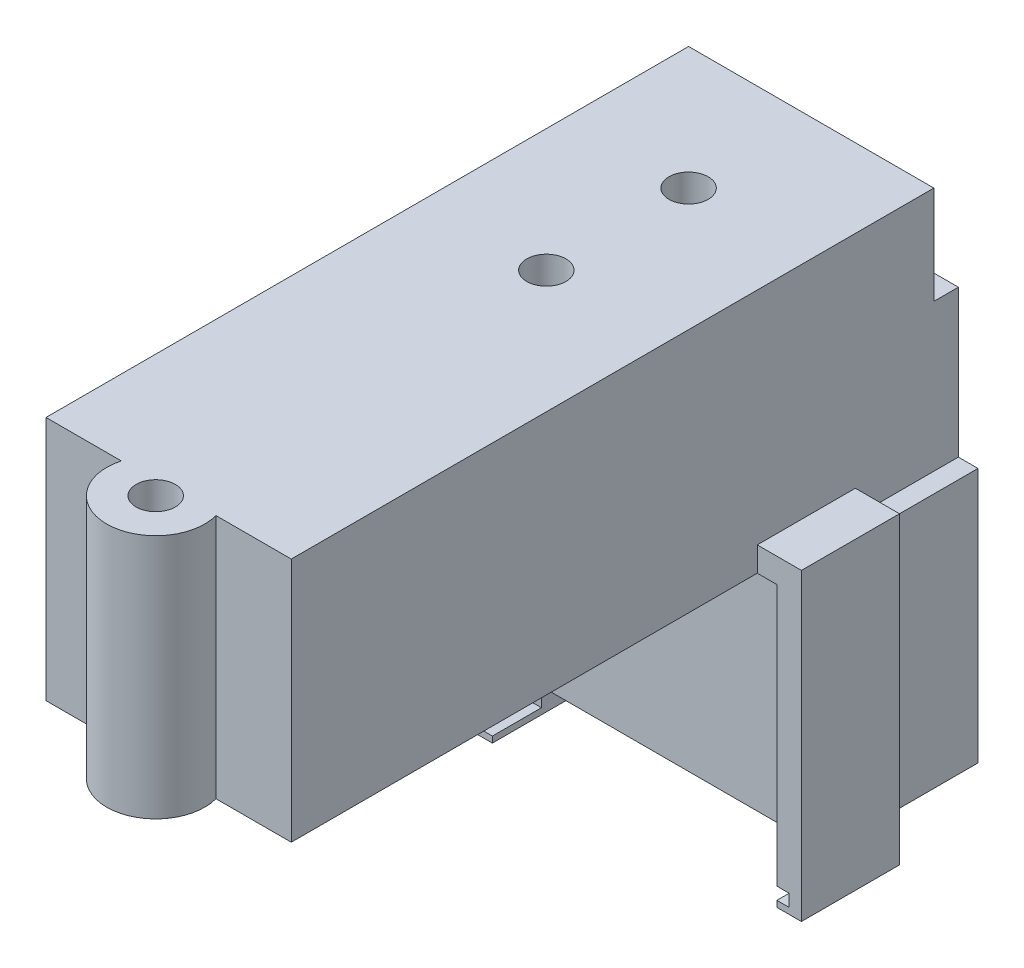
ISO-10303-21;
HEADER;
FILE_DESCRIPTION(('STEP AP214'),'2;1');
FILE_NAME('part.step','',(''),(''),'','','');
FILE_SCHEMA(('AUTOMOTIVE_DESIGN { 1 0 10303 214 1 1 1 1 }'));
ENDSEC;
DATA;
#1=APPLICATION_CONTEXT('core data for automotive mechanical design processes');
#2=APPLICATION_PROTOCOL_DEFINITION('international standard','automotive_design',2000,#1);
#3=PRODUCT_CONTEXT('',#1,'mechanical');
#4=PRODUCT('Part','Part','',(#3));
#5=PRODUCT_RELATED_PRODUCT_CATEGORY('part','',(#4));
#6=PRODUCT_DEFINITION_FORMATION('','',#4);
#7=PRODUCT_DEFINITION_CONTEXT('part definition',#1,'design');
#8=PRODUCT_DEFINITION('design','',#6,#7);
#9=PRODUCT_DEFINITION_SHAPE('','',#8);
#10=(LENGTH_UNIT() NAMED_UNIT(*) SI_UNIT(.MILLI.,.METRE.));
#11=(NAMED_UNIT(*) PLANE_ANGLE_UNIT() SI_UNIT($,.RADIAN.));
#12=(NAMED_UNIT(*) SI_UNIT($,.STERADIAN.) SOLID_ANGLE_UNIT());
#13=UNCERTAINTY_MEASURE_WITH_UNIT(LENGTH_MEASURE(1.E-05),#10,'distance_accuracy_value','');
#14=(GEOMETRIC_REPRESENTATION_CONTEXT(3) GLOBAL_UNCERTAINTY_ASSIGNED_CONTEXT((#13)) GLOBAL_UNIT_ASSIGNED_CONTEXT((#10,
#11,#12)) REPRESENTATION_CONTEXT('',''));
#15=CARTESIAN_POINT('',(0.,0.,0.));
#16=DIRECTION('',(0.,0.,1.));
#17=DIRECTION('',(1.,0.,0.));
#18=AXIS2_PLACEMENT_3D('',#15,#16,#17);
#19=CARTESIAN_POINT('',(25.,50.,58.63));
#20=DIRECTION('',(0.,-1.,0.));
#21=DIRECTION('',(0.,0.,-1.));
#22=AXIS2_PLACEMENT_3D('',#19,#20,#21);
#23=CYLINDRICAL_SURFACE('',#22,4.);
#24=CARTESIAN_POINT('',(25.,50.,58.63));
#25=DIRECTION('',(0.,-1.,0.));
#26=DIRECTION('',(0.,0.,-1.));
#27=AXIS2_PLACEMENT_3D('',#24,#25,#26);
#28=CIRCLE('',#27,4.);
#29=CARTESIAN_POINT('',(25.,50.,54.63));
#30=VERTEX_POINT('',#29);
#31=EDGE_CURVE('E294',#30,#30,#28,.T.);
#32=ORIENTED_EDGE('',*,*,#31,.F.);
#33=EDGE_LOOP('',(#32));
#34=FACE_BOUND('',#33,.T.);
#35=CARTESIAN_POINT('',(25.,10.,58.63));
#36=DIRECTION('',(0.,-1.,0.));
#37=DIRECTION('',(0.,0.,-1.));
#38=AXIS2_PLACEMENT_3D('',#35,#36,#37);
#39=CIRCLE('',#38,4.);
#40=CARTESIAN_POINT('',(25.,10.,54.63));
#41=VERTEX_POINT('',#40);
#42=EDGE_CURVE('E12',#41,#41,#39,.F.);
#43=ORIENTED_EDGE('',*,*,#42,.F.);
#44=EDGE_LOOP('',(#43));
#45=FACE_BOUND('',#44,.T.);
#46=ADVANCED_FACE('F47',(#34,#45),#23,.F.);
#47=CARTESIAN_POINT('',(0.,50.,0.));
#48=DIRECTION('',(1.,0.,0.));
#49=DIRECTION('',(0.,0.,-1.));
#50=AXIS2_PLACEMENT_3D('',#47,#48,#49);
#51=PLANE('',#50);
#52=DIRECTION('',(0.,1.,0.));
#53=VECTOR('',#52,1.);
#54=CARTESIAN_POINT('',(0.,5.,-59.));
#55=LINE('',#54,#53);
#56=CARTESIAN_POINT('',(0.,0.,-59.));
#57=VERTEX_POINT('',#56);
#58=CARTESIAN_POINT('',(0.,5.,-59.));
#59=VERTEX_POINT('',#58);
#60=EDGE_CURVE('E495',#57,#59,#55,.T.);
#61=ORIENTED_EDGE('',*,*,#60,.T.);
#62=DIRECTION('',(0.,0.,1.));
#63=VECTOR('',#62,1.);
#64=CARTESIAN_POINT('',(0.,5.,-59.));
#65=LINE('',#64,#63);
#66=CARTESIAN_POINT('',(0.,5.,-39.));
#67=VERTEX_POINT('',#66);
#68=EDGE_CURVE('E534',#59,#67,#65,.T.);
#69=ORIENTED_EDGE('',*,*,#68,.T.);
#70=DIRECTION('',(0.,1.,0.));
#71=VECTOR('',#70,1.);
#72=CARTESIAN_POINT('',(0.,5.,-39.));
#73=LINE('',#72,#71);
#74=CARTESIAN_POINT('',(0.,0.,-39.));
#75=VERTEX_POINT('',#74);
#76=EDGE_CURVE('E456',#75,#67,#73,.T.);
#77=ORIENTED_EDGE('',*,*,#76,.F.);
#78=DIRECTION('',(0.,0.,1.));
#79=VECTOR('',#78,1.);
#80=CARTESIAN_POINT('',(0.,0.,0.));
#81=LINE('',#80,#79);
#82=CARTESIAN_POINT('',(0.,0.,56.));
#83=VERTEX_POINT('',#82);
#84=EDGE_CURVE('E643',#75,#83,#81,.T.);
#85=ORIENTED_EDGE('',*,*,#84,.T.);
#86=DIRECTION('',(0.,-1.,0.));
#87=VECTOR('',#86,1.);
#88=CARTESIAN_POINT('',(0.,50.,56.));
#89=LINE('',#88,#87);
#90=CARTESIAN_POINT('',(0.,50.,56.));
#91=VERTEX_POINT('',#90);
#92=EDGE_CURVE('E315',#91,#83,#89,.T.);
#93=ORIENTED_EDGE('',*,*,#92,.F.);
#94=DIRECTION('',(0.,0.,1.));
#95=VECTOR('',#94,1.);
#96=CARTESIAN_POINT('',(0.,50.,0.));
#97=LINE('',#96,#95);
#98=CARTESIAN_POINT('',(0.,50.,-75.));
#99=VERTEX_POINT('',#98);
#100=EDGE_CURVE('E635',#99,#91,#97,.T.);
#101=ORIENTED_EDGE('',*,*,#100,.F.);
#102=DIRECTION('',(0.,1.,0.));
#103=VECTOR('',#102,1.);
#104=CARTESIAN_POINT('',(0.,50.,-75.));
#105=LINE('',#104,#103);
#106=CARTESIAN_POINT('',(0.,30.,-75.));
#107=VERTEX_POINT('',#106);
#108=EDGE_CURVE('E598',#107,#99,#105,.T.);
#109=ORIENTED_EDGE('',*,*,#108,.F.);
#110=DIRECTION('',(0.,0.,1.));
#111=VECTOR('',#110,1.);
#112=CARTESIAN_POINT('',(0.,30.,-75.));
#113=LINE('',#112,#111);
#114=CARTESIAN_POINT('',(0.,30.,-80.));
#115=VERTEX_POINT('',#114);
#116=EDGE_CURVE('E604',#115,#107,#113,.T.);
#117=ORIENTED_EDGE('',*,*,#116,.F.);
#118=DIRECTION('',(0.,-1.,0.));
#119=VECTOR('',#118,1.);
#120=CARTESIAN_POINT('',(0.,50.,-80.));
#121=LINE('',#120,#119);
#122=CARTESIAN_POINT('',(0.,0.,-80.));
#123=VERTEX_POINT('',#122);
#124=EDGE_CURVE('E638',#115,#123,#121,.T.);
#125=ORIENTED_EDGE('',*,*,#124,.T.);
#126=EDGE_CURVE('E628',#123,#57,#81,.T.);
#127=ORIENTED_EDGE('',*,*,#126,.T.);
#128=EDGE_LOOP('',(#61,#69,#77,#85,#93,#101,#109,#117,#125,#127));
#129=FACE_BOUND('',#128,.T.);
#130=ADVANCED_FACE('F700',(#129),#51,.F.);
#131=CARTESIAN_POINT('',(54.,0.,-80.));
#132=DIRECTION('',(0.,-1.,0.));
#133=DIRECTION('',(0.,0.,-1.));
#134=AXIS2_PLACEMENT_3D('',#131,#132,#133);
#135=PLANE('',#134);
#136=DIRECTION('',(1.,0.,0.));
#137=VECTOR('',#136,1.);
#138=CARTESIAN_POINT('',(0.,0.,-59.));
#139=LINE('',#138,#137);
#140=CARTESIAN_POINT('',(-3.99999999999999,0.,-59.));
#141=VERTEX_POINT('',#140);
#142=EDGE_CURVE('E491',#141,#57,#139,.T.);
#143=ORIENTED_EDGE('',*,*,#142,.T.);
#144=ORIENTED_EDGE('',*,*,#126,.F.);
#145=DIRECTION('',(-1.,0.,0.));
#146=VECTOR('',#145,1.);
#147=CARTESIAN_POINT('',(54.,0.,-80.));
#148=LINE('',#147,#146);
#149=CARTESIAN_POINT('',(-4.,0.,-80.));
#150=VERTEX_POINT('',#149);
#151=EDGE_CURVE('E589',#123,#150,#148,.T.);
#152=ORIENTED_EDGE('',*,*,#151,.T.);
#153=DIRECTION('',(0.,0.,1.));
#154=VECTOR('',#153,1.);
#155=CARTESIAN_POINT('',(-4.,0.,-80.));
#156=LINE('',#155,#154);
#157=EDGE_CURVE('E552',#150,#141,#156,.T.);
#158=ORIENTED_EDGE('',*,*,#157,.T.);
#159=EDGE_LOOP('',(#143,#144,#152,#158));
#160=FACE_BOUND('',#159,.T.);
#161=ADVANCED_FACE('F666',(#160),#135,.F.);
#162=CARTESIAN_POINT('',(-3.99999999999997,0.,0.));
#163=DIRECTION('',(-1.,0.,0.));
#164=DIRECTION('',(0.,0.,1.));
#165=AXIS2_PLACEMENT_3D('',#162,#163,#164);
#166=PLANE('',#165);
#167=DIRECTION('',(0.,0.,-1.));
#168=VECTOR('',#167,1.);
#169=CARTESIAN_POINT('',(-4.,-52.,-80.));
#170=LINE('',#169,#168);
#171=CARTESIAN_POINT('',(-3.99999999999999,-52.,-59.));
#172=VERTEX_POINT('',#171);
#173=CARTESIAN_POINT('',(-4.,-52.,-80.));
#174=VERTEX_POINT('',#173);
#175=EDGE_CURVE('E560',#172,#174,#170,.T.);
#176=ORIENTED_EDGE('',*,*,#175,.F.);
#177=DIRECTION('',(0.,1.,0.));
#178=VECTOR('',#177,1.);
#179=CARTESIAN_POINT('',(-3.99999999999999,0.,-59.));
#180=LINE('',#179,#178);
#181=EDGE_CURVE('E56',#172,#141,#180,.T.);
#182=ORIENTED_EDGE('',*,*,#181,.T.);
#183=ORIENTED_EDGE('',*,*,#157,.F.);
#184=DIRECTION('',(0.,1.,0.));
#185=VECTOR('',#184,1.);
#186=CARTESIAN_POINT('',(-4.,0.,-80.));
#187=LINE('',#186,#185);
#188=EDGE_CURVE('E548',#174,#150,#187,.T.);
#189=ORIENTED_EDGE('',*,*,#188,.F.);
#190=EDGE_LOOP('',(#176,#182,#183,#189));
#191=FACE_BOUND('',#190,.T.);
#192=ADVANCED_FACE('F662',(#191),#166,.T.);
#193=CARTESIAN_POINT('',(25.,50.,-21.));
#194=DIRECTION('',(0.,-1.,0.));
#195=DIRECTION('',(0.,0.,-1.));
#196=AXIS2_PLACEMENT_3D('',#193,#194,#195);
#197=CYLINDRICAL_SURFACE('',#196,4.);
#198=CARTESIAN_POINT('',(25.,50.,-21.));
#199=DIRECTION('',(0.,1.,0.));
#200=DIRECTION('',(0.,0.,1.));
#201=AXIS2_PLACEMENT_3D('',#198,#199,#200);
#202=CIRCLE('',#201,4.);
#203=CARTESIAN_POINT('',(25.,50.,-17.));
#204=VERTEX_POINT('',#203);
#205=EDGE_CURVE('E623',#204,#204,#202,.T.);
#206=ORIENTED_EDGE('',*,*,#205,.T.);
#207=EDGE_LOOP('',(#206));
#208=FACE_BOUND('',#207,.T.);
#209=CARTESIAN_POINT('',(25.,25.,-21.));
#210=DIRECTION('',(0.,-1.,0.));
#211=DIRECTION('',(0.,0.,-1.));
#212=AXIS2_PLACEMENT_3D('',#209,#210,#211);
#213=CIRCLE('',#212,4.);
#214=CARTESIAN_POINT('',(25.,25.,-25.));
#215=VERTEX_POINT('',#214);
#216=EDGE_CURVE('E544',#215,#215,#213,.T.);
#217=ORIENTED_EDGE('',*,*,#216,.T.);
#218=EDGE_LOOP('',(#217));
#219=FACE_BOUND('',#218,.T.);
#220=ADVANCED_FACE('F49',(#208,#219),#197,.F.);
#221=CARTESIAN_POINT('',(0.,0.,0.));
#222=DIRECTION('',(0.,1.,0.));
#223=DIRECTION('',(0.,0.,1.));
#224=AXIS2_PLACEMENT_3D('',#221,#222,#223);
#225=PLANE('',#224);
#226=CARTESIAN_POINT('',(25.,0.,-21.));
#227=DIRECTION('',(0.,-1.,0.));
#228=DIRECTION('',(0.,0.,-1.));
#229=AXIS2_PLACEMENT_3D('',#226,#227,#228);
#230=CIRCLE('',#229,7.5);
#231=CARTESIAN_POINT('',(25.,0.,-28.5));
#232=VERTEX_POINT('',#231);
#233=EDGE_CURVE('E515',#232,#232,#230,.T.);
#234=ORIENTED_EDGE('',*,*,#233,.F.);
#235=EDGE_LOOP('',(#234));
#236=FACE_BOUND('',#235,.T.);
#237=DIRECTION('',(-1.,0.,0.));
#238=VECTOR('',#237,1.);
#239=CARTESIAN_POINT('',(54.,0.,-49.));
#240=LINE('',#239,#238);
#241=CARTESIAN_POINT('',(54.,0.,-49.));
#242=VERTEX_POINT('',#241);
#243=CARTESIAN_POINT('',(-3.99999999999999,0.,-49.));
#244=VERTEX_POINT('',#243);
#245=EDGE_CURVE('E590',#242,#244,#240,.T.);
#246=ORIENTED_EDGE('',*,*,#245,.F.);
#247=DIRECTION('',(0.,0.,1.));
#248=VECTOR('',#247,1.);
#249=CARTESIAN_POINT('',(54.,0.,-59.));
#250=LINE('',#249,#248);
#251=CARTESIAN_POINT('',(54.,0.,-39.));
#252=VERTEX_POINT('',#251);
#253=EDGE_CURVE('E365',#242,#252,#250,.T.);
#254=ORIENTED_EDGE('',*,*,#253,.T.);
#255=DIRECTION('',(1.,0.,0.));
#256=VECTOR('',#255,1.);
#257=CARTESIAN_POINT('',(50.,0.,-39.));
#258=LINE('',#257,#256);
#259=CARTESIAN_POINT('',(50.,0.,-39.));
#260=VERTEX_POINT('',#259);
#261=EDGE_CURVE('E426',#260,#252,#258,.T.);
#262=ORIENTED_EDGE('',*,*,#261,.F.);
#263=DIRECTION('',(0.,0.,1.));
#264=VECTOR('',#263,1.);
#265=CARTESIAN_POINT('',(50.,0.,0.));
#266=LINE('',#265,#264);
#267=CARTESIAN_POINT('',(50.,0.,56.));
#268=VERTEX_POINT('',#267);
#269=EDGE_CURVE('E617',#260,#268,#266,.T.);
#270=ORIENTED_EDGE('',*,*,#269,.T.);
#271=DIRECTION('',(1.,0.,0.));
#272=VECTOR('',#271,1.);
#273=CARTESIAN_POINT('',(0.,0.,56.));
#274=LINE('',#273,#272);
#275=CARTESIAN_POINT('',(34.6479583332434,0.,56.));
#276=VERTEX_POINT('',#275);
#277=EDGE_CURVE('E306',#276,#268,#274,.T.);
#278=ORIENTED_EDGE('',*,*,#277,.F.);
#279=CARTESIAN_POINT('',(25.,0.,58.63));
#280=DIRECTION('',(0.,-1.,0.));
#281=DIRECTION('',(0.,0.,-1.));
#282=AXIS2_PLACEMENT_3D('',#279,#280,#281);
#283=CIRCLE('',#282,10.);
#284=CARTESIAN_POINT('',(15.3520416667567,0.,56.));
#285=VERTEX_POINT('',#284);
#286=EDGE_CURVE('E277',#276,#285,#283,.T.);
#287=ORIENTED_EDGE('',*,*,#286,.T.);
#288=EDGE_CURVE('E309',#83,#285,#274,.T.);
#289=ORIENTED_EDGE('',*,*,#288,.F.);
#290=ORIENTED_EDGE('',*,*,#84,.F.);
#291=DIRECTION('',(1.,0.,0.));
#292=VECTOR('',#291,1.);
#293=CARTESIAN_POINT('',(0.,0.,-39.));
#294=LINE('',#293,#292);
#295=CARTESIAN_POINT('',(-3.99999999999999,0.,-39.));
#296=VERTEX_POINT('',#295);
#297=EDGE_CURVE('E453',#296,#75,#294,.T.);
#298=ORIENTED_EDGE('',*,*,#297,.F.);
#299=DIRECTION('',(0.,0.,1.));
#300=VECTOR('',#299,1.);
#301=CARTESIAN_POINT('',(-3.99999999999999,0.,-59.));
#302=LINE('',#301,#300);
#303=EDGE_CURVE('E511',#244,#296,#302,.T.);
#304=ORIENTED_EDGE('',*,*,#303,.F.);
#305=EDGE_LOOP('',(#246,#254,#262,#270,#278,#287,#289,#290,#298,#304));
#306=FACE_BOUND('',#305,.T.);
#307=ADVANCED_FACE('F750',(#236,#306),#225,.F.);
#308=CARTESIAN_POINT('',(50.,50.,0.));
#309=DIRECTION('',(1.,0.,0.));
#310=DIRECTION('',(0.,0.,-1.));
#311=AXIS2_PLACEMENT_3D('',#308,#309,#310);
#312=PLANE('',#311);
#313=DIRECTION('',(0.,-1.,0.));
#314=VECTOR('',#313,1.);
#315=CARTESIAN_POINT('',(50.,5.,-59.));
#316=LINE('',#315,#314);
#317=CARTESIAN_POINT('',(50.,5.,-59.));
#318=VERTEX_POINT('',#317);
#319=CARTESIAN_POINT('',(50.,0.,-59.));
#320=VERTEX_POINT('',#319);
#321=EDGE_CURVE('E390',#318,#320,#316,.T.);
#322=ORIENTED_EDGE('',*,*,#321,.T.);
#323=CARTESIAN_POINT('',(50.,0.,-80.));
#324=VERTEX_POINT('',#323);
#325=EDGE_CURVE('E639',#324,#320,#266,.T.);
#326=ORIENTED_EDGE('',*,*,#325,.F.);
#327=DIRECTION('',(0.,-1.,0.));
#328=VECTOR('',#327,1.);
#329=CARTESIAN_POINT('',(50.,50.,-80.));
#330=LINE('',#329,#328);
#331=CARTESIAN_POINT('',(50.,30.,-80.));
#332=VERTEX_POINT('',#331);
#333=EDGE_CURVE('E649',#332,#324,#330,.T.);
#334=ORIENTED_EDGE('',*,*,#333,.F.);
#335=DIRECTION('',(0.,0.,1.));
#336=VECTOR('',#335,1.);
#337=CARTESIAN_POINT('',(50.,30.,-75.));
#338=LINE('',#337,#336);
#339=CARTESIAN_POINT('',(50.,30.,-75.));
#340=VERTEX_POINT('',#339);
#341=EDGE_CURVE('E603',#332,#340,#338,.T.);
#342=ORIENTED_EDGE('',*,*,#341,.T.);
#343=DIRECTION('',(0.,1.,0.));
#344=VECTOR('',#343,1.);
#345=CARTESIAN_POINT('',(50.,50.,-75.));
#346=LINE('',#345,#344);
#347=CARTESIAN_POINT('',(50.,50.,-75.));
#348=VERTEX_POINT('',#347);
#349=EDGE_CURVE('E599',#340,#348,#346,.T.);
#350=ORIENTED_EDGE('',*,*,#349,.T.);
#351=DIRECTION('',(0.,0.,1.));
#352=VECTOR('',#351,1.);
#353=CARTESIAN_POINT('',(50.,50.,0.));
#354=LINE('',#353,#352);
#355=CARTESIAN_POINT('',(50.,50.,56.));
#356=VERTEX_POINT('',#355);
#357=EDGE_CURVE('E632',#348,#356,#354,.T.);
#358=ORIENTED_EDGE('',*,*,#357,.T.);
#359=DIRECTION('',(0.,-1.,0.));
#360=VECTOR('',#359,1.);
#361=CARTESIAN_POINT('',(50.,50.,56.));
#362=LINE('',#361,#360);
#363=EDGE_CURVE('E290',#356,#268,#362,.T.);
#364=ORIENTED_EDGE('',*,*,#363,.T.);
#365=ORIENTED_EDGE('',*,*,#269,.F.);
#366=DIRECTION('',(0.,-1.,0.));
#367=VECTOR('',#366,1.);
#368=CARTESIAN_POINT('',(50.,5.,-39.));
#369=LINE('',#368,#367);
#370=CARTESIAN_POINT('',(50.,5.,-39.));
#371=VERTEX_POINT('',#370);
#372=EDGE_CURVE('E430',#371,#260,#369,.T.);
#373=ORIENTED_EDGE('',*,*,#372,.F.);
#374=DIRECTION('',(0.,0.,1.));
#375=VECTOR('',#374,1.);
#376=CARTESIAN_POINT('',(50.,5.,-59.));
#377=LINE('',#376,#375);
#378=EDGE_CURVE('E362',#318,#371,#377,.T.);
#379=ORIENTED_EDGE('',*,*,#378,.F.);
#380=EDGE_LOOP('',(#322,#326,#334,#342,#350,#358,#364,#365,#373,#379));
#381=FACE_BOUND('',#380,.T.);
#382=ADVANCED_FACE('F752',(#381),#312,.T.);
#383=CARTESIAN_POINT('',(0.,50.,-80.));
#384=DIRECTION('',(0.,0.,-1.));
#385=DIRECTION('',(-1.,0.,0.));
#386=AXIS2_PLACEMENT_3D('',#383,#384,#385);
#387=PLANE('',#386);
#388=DIRECTION('',(-1.,0.,0.));
#389=VECTOR('',#388,1.);
#390=CARTESIAN_POINT('',(50.,30.,-80.));
#391=LINE('',#390,#389);
#392=EDGE_CURVE('E618',#332,#115,#391,.T.);
#393=ORIENTED_EDGE('',*,*,#392,.F.);
#394=ORIENTED_EDGE('',*,*,#333,.T.);
#395=CARTESIAN_POINT('',(54.,0.,-80.));
#396=VERTEX_POINT('',#395);
#397=EDGE_CURVE('E594',#396,#324,#148,.T.);
#398=ORIENTED_EDGE('',*,*,#397,.F.);
#399=DIRECTION('',(0.,1.,0.));
#400=VECTOR('',#399,1.);
#401=CARTESIAN_POINT('',(54.,0.,-80.));
#402=LINE('',#401,#400);
#403=CARTESIAN_POINT('',(54.,-52.,-80.));
#404=VERTEX_POINT('',#403);
#405=EDGE_CURVE('E565',#404,#396,#402,.T.);
#406=ORIENTED_EDGE('',*,*,#405,.F.);
#407=DIRECTION('',(-1.,0.,0.));
#408=VECTOR('',#407,1.);
#409=CARTESIAN_POINT('',(54.,-52.,-80.));
#410=LINE('',#409,#408);
#411=EDGE_CURVE('E581',#404,#174,#410,.T.);
#412=ORIENTED_EDGE('',*,*,#411,.T.);
#413=ORIENTED_EDGE('',*,*,#188,.T.);
#414=ORIENTED_EDGE('',*,*,#151,.F.);
#415=ORIENTED_EDGE('',*,*,#124,.F.);
#416=EDGE_LOOP('',(#393,#394,#398,#406,#412,#413,#414,#415));
#417=FACE_BOUND('',#416,.T.);
#418=ADVANCED_FACE('F780',(#417),#387,.T.);
#419=CARTESIAN_POINT('',(25.,50.,-50.));
#420=DIRECTION('',(0.,-1.,0.));
#421=DIRECTION('',(0.,0.,-1.));
#422=AXIS2_PLACEMENT_3D('',#419,#420,#421);
#423=CYLINDRICAL_SURFACE('',#422,3.99999999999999);
#424=CARTESIAN_POINT('',(25.,10.,-50.));
#425=DIRECTION('',(0.,1.,0.));
#426=DIRECTION('',(0.,0.,1.));
#427=AXIS2_PLACEMENT_3D('',#424,#425,#426);
#428=CIRCLE('',#427,3.99999999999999);
#429=CARTESIAN_POINT('',(25.,10.,-46.));
#430=VERTEX_POINT('',#429);
#431=EDGE_CURVE('E593',#430,#430,#428,.T.);
#432=ORIENTED_EDGE('',*,*,#431,.F.);
#433=EDGE_LOOP('',(#432));
#434=FACE_BOUND('',#433,.T.);
#435=CARTESIAN_POINT('',(25.,50.,-50.));
#436=DIRECTION('',(0.,1.,0.));
#437=DIRECTION('',(0.,0.,1.));
#438=AXIS2_PLACEMENT_3D('',#435,#436,#437);
#439=CIRCLE('',#438,3.99999999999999);
#440=CARTESIAN_POINT('',(25.,50.,-46.));
#441=VERTEX_POINT('',#440);
#442=EDGE_CURVE('E627',#441,#441,#439,.T.);
#443=ORIENTED_EDGE('',*,*,#442,.T.);
#444=EDGE_LOOP('',(#443));
#445=FACE_BOUND('',#444,.T.);
#446=ADVANCED_FACE('F771',(#434,#445),#423,.F.);
#447=CARTESIAN_POINT('',(0.,50.,0.));
#448=DIRECTION('',(0.,1.,0.));
#449=DIRECTION('',(0.,0.,1.));
#450=AXIS2_PLACEMENT_3D('',#447,#448,#449);
#451=PLANE('',#450);
#452=DIRECTION('',(-1.,0.,0.));
#453=VECTOR('',#452,1.);
#454=CARTESIAN_POINT('',(50.,50.,-75.));
#455=LINE('',#454,#453);
#456=EDGE_CURVE('E608',#348,#99,#455,.T.);
#457=ORIENTED_EDGE('',*,*,#456,.T.);
#458=ORIENTED_EDGE('',*,*,#100,.T.);
#459=DIRECTION('',(1.,0.,0.));
#460=VECTOR('',#459,1.);
#461=CARTESIAN_POINT('',(0.,50.,56.));
#462=LINE('',#461,#460);
#463=CARTESIAN_POINT('',(15.3520416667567,50.,56.));
#464=VERTEX_POINT('',#463);
#465=EDGE_CURVE('E283',#91,#464,#462,.T.);
#466=ORIENTED_EDGE('',*,*,#465,.T.);
#467=CARTESIAN_POINT('',(25.,50.,58.63));
#468=DIRECTION('',(0.,-1.,0.));
#469=DIRECTION('',(0.,0.,-1.));
#470=AXIS2_PLACEMENT_3D('',#467,#468,#469);
#471=CIRCLE('',#470,10.);
#472=CARTESIAN_POINT('',(34.6479583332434,50.,56.));
#473=VERTEX_POINT('',#472);
#474=EDGE_CURVE('E275',#473,#464,#471,.T.);
#475=ORIENTED_EDGE('',*,*,#474,.F.);
#476=EDGE_CURVE('E287',#473,#356,#462,.T.);
#477=ORIENTED_EDGE('',*,*,#476,.T.);
#478=ORIENTED_EDGE('',*,*,#357,.F.);
#479=EDGE_LOOP('',(#457,#458,#466,#475,#477,#478));
#480=FACE_BOUND('',#479,.T.);
#481=ORIENTED_EDGE('',*,*,#205,.F.);
#482=EDGE_LOOP('',(#481));
#483=FACE_BOUND('',#482,.T.);
#484=ORIENTED_EDGE('',*,*,#442,.F.);
#485=EDGE_LOOP('',(#484));
#486=FACE_BOUND('',#485,.T.);
#487=ORIENTED_EDGE('',*,*,#31,.T.);
#488=EDGE_LOOP('',(#487));
#489=FACE_BOUND('',#488,.T.);
#490=ADVANCED_FACE('F297',(#480,#483,#486,#489),#451,.T.);
#491=CARTESIAN_POINT('',(50.,50.,-75.));
#492=DIRECTION('',(0.,0.,1.));
#493=DIRECTION('',(1.,0.,0.));
#494=AXIS2_PLACEMENT_3D('',#491,#492,#493);
#495=PLANE('',#494);
#496=ORIENTED_EDGE('',*,*,#108,.T.);
#497=ORIENTED_EDGE('',*,*,#456,.F.);
#498=ORIENTED_EDGE('',*,*,#349,.F.);
#499=DIRECTION('',(-1.,0.,0.));
#500=VECTOR('',#499,1.);
#501=CARTESIAN_POINT('',(50.,30.,-75.));
#502=LINE('',#501,#500);
#503=EDGE_CURVE('E614',#340,#107,#502,.T.);
#504=ORIENTED_EDGE('',*,*,#503,.T.);
#505=EDGE_LOOP('',(#496,#497,#498,#504));
#506=FACE_BOUND('',#505,.T.);
#507=ADVANCED_FACE('F770',(#506),#495,.F.);
#508=CARTESIAN_POINT('',(50.,30.,-75.));
#509=DIRECTION('',(0.,-1.,0.));
#510=DIRECTION('',(0.,0.,-1.));
#511=AXIS2_PLACEMENT_3D('',#508,#509,#510);
#512=PLANE('',#511);
#513=ORIENTED_EDGE('',*,*,#116,.T.);
#514=ORIENTED_EDGE('',*,*,#503,.F.);
#515=ORIENTED_EDGE('',*,*,#341,.F.);
#516=ORIENTED_EDGE('',*,*,#392,.T.);
#517=EDGE_LOOP('',(#513,#514,#515,#516));
#518=FACE_BOUND('',#517,.T.);
#519=ADVANCED_FACE('F777',(#518),#512,.F.);
#520=CARTESIAN_POINT('',(0.,10.,0.));
#521=DIRECTION('',(0.,1.,0.));
#522=DIRECTION('',(0.,0.,1.));
#523=AXIS2_PLACEMENT_3D('',#520,#521,#522);
#524=PLANE('',#523);
#525=ORIENTED_EDGE('',*,*,#431,.T.);
#526=EDGE_LOOP('',(#525));
#527=FACE_BOUND('',#526,.T.);
#528=ADVANCED_FACE('F818',(#527),#524,.T.);
#529=ORIENTED_EDGE('',*,*,#325,.T.);
#530=DIRECTION('',(1.,0.,0.));
#531=VECTOR('',#530,1.);
#532=CARTESIAN_POINT('',(50.,0.,-59.));
#533=LINE('',#532,#531);
#534=CARTESIAN_POINT('',(54.,0.,-59.));
#535=VERTEX_POINT('',#534);
#536=EDGE_CURVE('E386',#320,#535,#533,.T.);
#537=ORIENTED_EDGE('',*,*,#536,.T.);
#538=DIRECTION('',(0.,0.,1.));
#539=VECTOR('',#538,1.);
#540=CARTESIAN_POINT('',(54.,0.,-80.));
#541=LINE('',#540,#539);
#542=EDGE_CURVE('E569',#396,#535,#541,.T.);
#543=ORIENTED_EDGE('',*,*,#542,.F.);
#544=ORIENTED_EDGE('',*,*,#397,.T.);
#545=EDGE_LOOP('',(#529,#537,#543,#544));
#546=FACE_BOUND('',#545,.T.);
#547=ADVANCED_FACE('F822',(#546),#135,.F.);
#548=CARTESIAN_POINT('',(54.,0.,-49.));
#549=DIRECTION('',(0.,0.,-1.));
#550=DIRECTION('',(-1.,0.,0.));
#551=AXIS2_PLACEMENT_3D('',#548,#549,#550);
#552=PLANE('',#551);
#553=DIRECTION('',(0.,-1.,0.));
#554=VECTOR('',#553,1.);
#555=CARTESIAN_POINT('',(54.,0.,-49.));
#556=LINE('',#555,#554);
#557=CARTESIAN_POINT('',(54.,-52.,-49.));
#558=VERTEX_POINT('',#557);
#559=EDGE_CURVE('E573',#242,#558,#556,.T.);
#560=ORIENTED_EDGE('',*,*,#559,.F.);
#561=ORIENTED_EDGE('',*,*,#245,.T.);
#562=DIRECTION('',(0.,-1.,0.));
#563=VECTOR('',#562,1.);
#564=CARTESIAN_POINT('',(-3.99999999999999,0.,-49.));
#565=LINE('',#564,#563);
#566=CARTESIAN_POINT('',(-3.99999999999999,-52.,-49.));
#567=VERTEX_POINT('',#566);
#568=EDGE_CURVE('E556',#244,#567,#565,.T.);
#569=ORIENTED_EDGE('',*,*,#568,.T.);
#570=DIRECTION('',(-1.,0.,0.));
#571=VECTOR('',#570,1.);
#572=CARTESIAN_POINT('',(54.,-52.,-49.));
#573=LINE('',#572,#571);
#574=EDGE_CURVE('E585',#558,#567,#573,.T.);
#575=ORIENTED_EDGE('',*,*,#574,.F.);
#576=EDGE_LOOP('',(#560,#561,#569,#575));
#577=FACE_BOUND('',#576,.T.);
#578=ADVANCED_FACE('F835',(#577),#552,.F.);
#579=CARTESIAN_POINT('',(54.,-52.,-80.));
#580=DIRECTION('',(0.,1.,0.));
#581=DIRECTION('',(0.,0.,1.));
#582=AXIS2_PLACEMENT_3D('',#579,#580,#581);
#583=PLANE('',#582);
#584=ORIENTED_EDGE('',*,*,#574,.T.);
#585=EDGE_CURVE('E561',#567,#172,#170,.T.);
#586=ORIENTED_EDGE('',*,*,#585,.T.);
#587=ORIENTED_EDGE('',*,*,#175,.T.);
#588=ORIENTED_EDGE('',*,*,#411,.F.);
#589=DIRECTION('',(0.,0.,-1.));
#590=VECTOR('',#589,1.);
#591=CARTESIAN_POINT('',(54.,-52.,-80.));
#592=LINE('',#591,#590);
#593=CARTESIAN_POINT('',(54.,-52.,-59.));
#594=VERTEX_POINT('',#593);
#595=EDGE_CURVE('E576',#594,#404,#592,.T.);
#596=ORIENTED_EDGE('',*,*,#595,.F.);
#597=EDGE_CURVE('E577',#558,#594,#592,.T.);
#598=ORIENTED_EDGE('',*,*,#597,.F.);
#599=EDGE_LOOP('',(#584,#586,#587,#588,#596,#598));
#600=FACE_BOUND('',#599,.T.);
#601=ADVANCED_FACE('F844',(#600),#583,.F.);
#602=CARTESIAN_POINT('',(54.,0.,0.));
#603=DIRECTION('',(-1.,0.,0.));
#604=DIRECTION('',(0.,0.,1.));
#605=AXIS2_PLACEMENT_3D('',#602,#603,#604);
#606=PLANE('',#605);
#607=ORIENTED_EDGE('',*,*,#542,.T.);
#608=DIRECTION('',(0.,-1.,0.));
#609=VECTOR('',#608,1.);
#610=CARTESIAN_POINT('',(54.,0.,-59.));
#611=LINE('',#610,#609);
#612=EDGE_CURVE('E382',#535,#594,#611,.T.);
#613=ORIENTED_EDGE('',*,*,#612,.T.);
#614=ORIENTED_EDGE('',*,*,#595,.T.);
#615=ORIENTED_EDGE('',*,*,#405,.T.);
#616=EDGE_LOOP('',(#607,#613,#614,#615));
#617=FACE_BOUND('',#616,.T.);
#618=ADVANCED_FACE('F852',(#617),#606,.F.);
#619=CARTESIAN_POINT('',(25.,25.,-21.));
#620=DIRECTION('',(0.,-1.,0.));
#621=DIRECTION('',(0.,0.,-1.));
#622=AXIS2_PLACEMENT_3D('',#619,#620,#621);
#623=CYLINDRICAL_SURFACE('',#622,7.5);
#624=CARTESIAN_POINT('',(25.,25.,-21.));
#625=DIRECTION('',(0.,-1.,0.));
#626=DIRECTION('',(0.,0.,-1.));
#627=AXIS2_PLACEMENT_3D('',#624,#625,#626);
#628=CIRCLE('',#627,7.5);
#629=CARTESIAN_POINT('',(25.,25.,-28.5));
#630=VERTEX_POINT('',#629);
#631=EDGE_CURVE('E540',#630,#630,#628,.T.);
#632=ORIENTED_EDGE('',*,*,#631,.F.);
#633=EDGE_LOOP('',(#632));
#634=FACE_BOUND('',#633,.T.);
#635=ORIENTED_EDGE('',*,*,#233,.T.);
#636=EDGE_LOOP('',(#635));
#637=FACE_BOUND('',#636,.T.);
#638=ADVANCED_FACE('F860',(#634,#637),#623,.F.);
#639=CARTESIAN_POINT('',(25.,25.,-21.));
#640=DIRECTION('',(0.,-1.,0.));
#641=DIRECTION('',(0.,0.,-1.));
#642=AXIS2_PLACEMENT_3D('',#639,#640,#641);
#643=PLANE('',#642);
#644=ORIENTED_EDGE('',*,*,#216,.F.);
#645=EDGE_LOOP('',(#644));
#646=FACE_BOUND('',#645,.T.);
#647=ORIENTED_EDGE('',*,*,#631,.T.);
#648=EDGE_LOOP('',(#647));
#649=FACE_BOUND('',#648,.T.);
#650=ADVANCED_FACE('F869',(#646,#649),#643,.T.);
#651=CARTESIAN_POINT('',(-3.99999999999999,-53.25,-59.));
#652=DIRECTION('',(1.,0.,0.));
#653=DIRECTION('',(0.,0.,-1.));
#654=AXIS2_PLACEMENT_3D('',#651,#652,#653);
#655=PLANE('',#654);
#656=ORIENTED_EDGE('',*,*,#568,.F.);
#657=ORIENTED_EDGE('',*,*,#303,.T.);
#658=DIRECTION('',(0.,1.,0.));
#659=VECTOR('',#658,1.);
#660=CARTESIAN_POINT('',(-3.99999999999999,-53.25,-39.));
#661=LINE('',#660,#659);
#662=CARTESIAN_POINT('',(-3.99999999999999,-53.25,-39.));
#663=VERTEX_POINT('',#662);
#664=EDGE_CURVE('E449',#663,#296,#661,.T.);
#665=ORIENTED_EDGE('',*,*,#664,.F.);
#666=DIRECTION('',(0.,0.,1.));
#667=VECTOR('',#666,1.);
#668=CARTESIAN_POINT('',(-3.99999999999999,-53.25,-59.));
#669=LINE('',#668,#667);
#670=CARTESIAN_POINT('',(-3.99999999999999,-53.25,-49.));
#671=VERTEX_POINT('',#670);
#672=EDGE_CURVE('E512',#671,#663,#669,.T.);
#673=ORIENTED_EDGE('',*,*,#672,.F.);
#674=DIRECTION('',(0.,1.,0.));
#675=VECTOR('',#674,1.);
#676=CARTESIAN_POINT('',(-4.00000000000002,-53.25,-49.));
#677=LINE('',#676,#675);
#678=CARTESIAN_POINT('',(-4.00000000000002,-55.75,-49.));
#679=VERTEX_POINT('',#678);
#680=EDGE_CURVE('E343',#679,#671,#677,.T.);
#681=ORIENTED_EDGE('',*,*,#680,.F.);
#682=DIRECTION('',(0.,0.,1.));
#683=VECTOR('',#682,1.);
#684=CARTESIAN_POINT('',(-4.00000000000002,-55.75,-59.));
#685=LINE('',#684,#683);
#686=CARTESIAN_POINT('',(-4.00000000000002,-55.75,-39.));
#687=VERTEX_POINT('',#686);
#688=EDGE_CURVE('E522',#679,#687,#685,.T.);
#689=ORIENTED_EDGE('',*,*,#688,.T.);
#690=DIRECTION('',(0.,1.,0.));
#691=VECTOR('',#690,1.);
#692=CARTESIAN_POINT('',(-4.00000000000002,-55.75,-39.));
#693=LINE('',#692,#691);
#694=CARTESIAN_POINT('',(-3.99999999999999,-57.,-39.));
#695=VERTEX_POINT('',#694);
#696=EDGE_CURVE('E471',#695,#687,#693,.T.);
#697=ORIENTED_EDGE('',*,*,#696,.F.);
#698=DIRECTION('',(0.,0.,1.));
#699=VECTOR('',#698,1.);
#700=CARTESIAN_POINT('',(-3.99999999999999,-57.,-59.));
#701=LINE('',#700,#699);
#702=CARTESIAN_POINT('',(-3.99999999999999,-57.,-59.));
#703=VERTEX_POINT('',#702);
#704=EDGE_CURVE('E525',#703,#695,#701,.T.);
#705=ORIENTED_EDGE('',*,*,#704,.F.);
#706=DIRECTION('',(0.,1.,0.));
#707=VECTOR('',#706,1.);
#708=CARTESIAN_POINT('',(-3.99999999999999,-53.25,-59.));
#709=LINE('',#708,#707);
#710=EDGE_CURVE('E487',#703,#172,#709,.T.);
#711=ORIENTED_EDGE('',*,*,#710,.T.);
#712=ORIENTED_EDGE('',*,*,#585,.F.);
#713=EDGE_LOOP('',(#656,#657,#665,#673,#681,#689,#697,#705,#711,#712));
#714=FACE_BOUND('',#713,.T.);
#715=ADVANCED_FACE('F877',(#714),#655,.T.);
#716=CARTESIAN_POINT('',(-3.99999999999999,-53.25,-59.));
#717=DIRECTION('',(0.,-1.,0.));
#718=DIRECTION('',(0.,0.,-1.));
#719=AXIS2_PLACEMENT_3D('',#716,#717,#718);
#720=PLANE('',#719);
#721=DIRECTION('',(-1.,0.,0.));
#722=VECTOR('',#721,1.);
#723=CARTESIAN_POINT('',(-6.49999999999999,-53.25,-49.));
#724=LINE('',#723,#722);
#725=CARTESIAN_POINT('',(-6.49999999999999,-53.25,-49.));
#726=VERTEX_POINT('',#725);
#727=EDGE_CURVE('E347',#671,#726,#724,.T.);
#728=ORIENTED_EDGE('',*,*,#727,.F.);
#729=ORIENTED_EDGE('',*,*,#672,.T.);
#730=DIRECTION('',(1.,0.,0.));
#731=VECTOR('',#730,1.);
#732=CARTESIAN_POINT('',(-3.99999999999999,-53.25,-39.));
#733=LINE('',#732,#731);
#734=CARTESIAN_POINT('',(-6.49999999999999,-53.25,-39.));
#735=VERTEX_POINT('',#734);
#736=EDGE_CURVE('E483',#735,#663,#733,.T.);
#737=ORIENTED_EDGE('',*,*,#736,.F.);
#738=DIRECTION('',(0.,0.,1.));
#739=VECTOR('',#738,1.);
#740=CARTESIAN_POINT('',(-6.49999999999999,-53.25,-59.));
#741=LINE('',#740,#739);
#742=EDGE_CURVE('E516',#726,#735,#741,.T.);
#743=ORIENTED_EDGE('',*,*,#742,.F.);
#744=EDGE_LOOP('',(#728,#729,#737,#743));
#745=FACE_BOUND('',#744,.T.);
#746=ADVANCED_FACE('F886',(#745),#720,.T.);
#747=CARTESIAN_POINT('',(-6.49999999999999,-53.25,-59.));
#748=DIRECTION('',(1.,0.,0.));
#749=DIRECTION('',(0.,0.,-1.));
#750=AXIS2_PLACEMENT_3D('',#747,#748,#749);
#751=PLANE('',#750);
#752=DIRECTION('',(0.,-1.,0.));
#753=VECTOR('',#752,1.);
#754=CARTESIAN_POINT('',(-6.49999999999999,-53.25,-49.));
#755=LINE('',#754,#753);
#756=CARTESIAN_POINT('',(-6.49999999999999,-55.75,-49.));
#757=VERTEX_POINT('',#756);
#758=EDGE_CURVE('E335',#726,#757,#755,.T.);
#759=ORIENTED_EDGE('',*,*,#758,.F.);
#760=ORIENTED_EDGE('',*,*,#742,.T.);
#761=DIRECTION('',(0.,1.,0.));
#762=VECTOR('',#761,1.);
#763=CARTESIAN_POINT('',(-6.49999999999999,-53.25,-39.));
#764=LINE('',#763,#762);
#765=CARTESIAN_POINT('',(-6.49999999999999,-55.75,-39.));
#766=VERTEX_POINT('',#765);
#767=EDGE_CURVE('E479',#766,#735,#764,.T.);
#768=ORIENTED_EDGE('',*,*,#767,.F.);
#769=DIRECTION('',(0.,0.,1.));
#770=VECTOR('',#769,1.);
#771=CARTESIAN_POINT('',(-6.49999999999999,-55.75,-59.));
#772=LINE('',#771,#770);
#773=EDGE_CURVE('E519',#757,#766,#772,.T.);
#774=ORIENTED_EDGE('',*,*,#773,.F.);
#775=EDGE_LOOP('',(#759,#760,#768,#774));
#776=FACE_BOUND('',#775,.T.);
#777=ADVANCED_FACE('F895',(#776),#751,.T.);
#778=CARTESIAN_POINT('',(-4.00000000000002,-55.75,-59.));
#779=DIRECTION('',(0.,1.,0.));
#780=DIRECTION('',(0.,0.,1.));
#781=AXIS2_PLACEMENT_3D('',#778,#779,#780);
#782=PLANE('',#781);
#783=DIRECTION('',(1.,0.,0.));
#784=VECTOR('',#783,1.);
#785=CARTESIAN_POINT('',(-6.49999999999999,-55.75,-49.));
#786=LINE('',#785,#784);
#787=EDGE_CURVE('E339',#757,#679,#786,.T.);
#788=ORIENTED_EDGE('',*,*,#787,.F.);
#789=ORIENTED_EDGE('',*,*,#773,.T.);
#790=DIRECTION('',(-1.,0.,0.));
#791=VECTOR('',#790,1.);
#792=CARTESIAN_POINT('',(-4.00000000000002,-55.75,-39.));
#793=LINE('',#792,#791);
#794=EDGE_CURVE('E475',#687,#766,#793,.T.);
#795=ORIENTED_EDGE('',*,*,#794,.F.);
#796=ORIENTED_EDGE('',*,*,#688,.F.);
#797=EDGE_LOOP('',(#788,#789,#795,#796));
#798=FACE_BOUND('',#797,.T.);
#799=ADVANCED_FACE('F903',(#798),#782,.T.);
#800=CARTESIAN_POINT('',(-8.99999999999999,-57.,-59.));
#801=DIRECTION('',(0.,-1.,0.));
#802=DIRECTION('',(0.,0.,-1.));
#803=AXIS2_PLACEMENT_3D('',#800,#801,#802);
#804=PLANE('',#803);
#805=ORIENTED_EDGE('',*,*,#704,.T.);
#806=DIRECTION('',(1.,0.,0.));
#807=VECTOR('',#806,1.);
#808=CARTESIAN_POINT('',(-8.99999999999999,-57.,-39.));
#809=LINE('',#808,#807);
#810=CARTESIAN_POINT('',(-8.99999999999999,-57.,-39.));
#811=VERTEX_POINT('',#810);
#812=EDGE_CURVE('E467',#811,#695,#809,.T.);
#813=ORIENTED_EDGE('',*,*,#812,.F.);
#814=DIRECTION('',(0.,0.,1.));
#815=VECTOR('',#814,1.);
#816=CARTESIAN_POINT('',(-8.99999999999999,-57.,-59.));
#817=LINE('',#816,#815);
#818=CARTESIAN_POINT('',(-8.99999999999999,-57.,-59.));
#819=VERTEX_POINT('',#818);
#820=EDGE_CURVE('E528',#819,#811,#817,.T.);
#821=ORIENTED_EDGE('',*,*,#820,.F.);
#822=DIRECTION('',(1.,0.,0.));
#823=VECTOR('',#822,1.);
#824=CARTESIAN_POINT('',(-8.99999999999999,-57.,-59.));
#825=LINE('',#824,#823);
#826=EDGE_CURVE('E507',#819,#703,#825,.T.);
#827=ORIENTED_EDGE('',*,*,#826,.T.);
#828=EDGE_LOOP('',(#805,#813,#821,#827));
#829=FACE_BOUND('',#828,.T.);
#830=ADVANCED_FACE('F911',(#829),#804,.T.);
#831=CARTESIAN_POINT('',(-8.99999999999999,5.,-59.));
#832=DIRECTION('',(-1.,0.,0.));
#833=DIRECTION('',(0.,0.,1.));
#834=AXIS2_PLACEMENT_3D('',#831,#832,#833);
#835=PLANE('',#834);
#836=ORIENTED_EDGE('',*,*,#820,.T.);
#837=DIRECTION('',(0.,-1.,0.));
#838=VECTOR('',#837,1.);
#839=CARTESIAN_POINT('',(-8.99999999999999,5.,-39.));
#840=LINE('',#839,#838);
#841=CARTESIAN_POINT('',(-8.99999999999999,5.,-39.));
#842=VERTEX_POINT('',#841);
#843=EDGE_CURVE('E463',#842,#811,#840,.T.);
#844=ORIENTED_EDGE('',*,*,#843,.F.);
#845=DIRECTION('',(0.,0.,1.));
#846=VECTOR('',#845,1.);
#847=CARTESIAN_POINT('',(-8.99999999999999,5.,-59.));
#848=LINE('',#847,#846);
#849=CARTESIAN_POINT('',(-8.99999999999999,5.,-59.));
#850=VERTEX_POINT('',#849);
#851=EDGE_CURVE('E531',#850,#842,#848,.T.);
#852=ORIENTED_EDGE('',*,*,#851,.F.);
#853=DIRECTION('',(0.,-1.,0.));
#854=VECTOR('',#853,1.);
#855=CARTESIAN_POINT('',(-8.99999999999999,5.,-59.));
#856=LINE('',#855,#854);
#857=EDGE_CURVE('E503',#850,#819,#856,.T.);
#858=ORIENTED_EDGE('',*,*,#857,.T.);
#859=EDGE_LOOP('',(#836,#844,#852,#858));
#860=FACE_BOUND('',#859,.T.);
#861=ADVANCED_FACE('F919',(#860),#835,.T.);
#862=CARTESIAN_POINT('',(0.,5.,-59.));
#863=DIRECTION('',(0.,1.,0.));
#864=DIRECTION('',(0.,0.,1.));
#865=AXIS2_PLACEMENT_3D('',#862,#863,#864);
#866=PLANE('',#865);
#867=ORIENTED_EDGE('',*,*,#851,.T.);
#868=DIRECTION('',(-1.,0.,0.));
#869=VECTOR('',#868,1.);
#870=CARTESIAN_POINT('',(0.,5.,-39.));
#871=LINE('',#870,#869);
#872=EDGE_CURVE('E459',#67,#842,#871,.T.);
#873=ORIENTED_EDGE('',*,*,#872,.F.);
#874=ORIENTED_EDGE('',*,*,#68,.F.);
#875=DIRECTION('',(-1.,0.,0.));
#876=VECTOR('',#875,1.);
#877=CARTESIAN_POINT('',(0.,5.,-59.));
#878=LINE('',#877,#876);
#879=EDGE_CURVE('E499',#59,#850,#878,.T.);
#880=ORIENTED_EDGE('',*,*,#879,.T.);
#881=EDGE_LOOP('',(#867,#873,#874,#880));
#882=FACE_BOUND('',#881,.T.);
#883=ADVANCED_FACE('F927',(#882),#866,.T.);
#884=CARTESIAN_POINT('',(0.,0.,-59.));
#885=DIRECTION('',(0.,0.,1.));
#886=DIRECTION('',(1.,0.,0.));
#887=AXIS2_PLACEMENT_3D('',#884,#885,#886);
#888=PLANE('',#887);
#889=ORIENTED_EDGE('',*,*,#710,.F.);
#890=ORIENTED_EDGE('',*,*,#826,.F.);
#891=ORIENTED_EDGE('',*,*,#857,.F.);
#892=ORIENTED_EDGE('',*,*,#879,.F.);
#893=ORIENTED_EDGE('',*,*,#60,.F.);
#894=ORIENTED_EDGE('',*,*,#142,.F.);
#895=ORIENTED_EDGE('',*,*,#181,.F.);
#896=EDGE_LOOP('',(#889,#890,#891,#892,#893,#894,#895));
#897=FACE_BOUND('',#896,.T.);
#898=ADVANCED_FACE('F935',(#897),#888,.F.);
#899=CARTESIAN_POINT('',(0.,0.,-39.));
#900=DIRECTION('',(0.,0.,1.));
#901=DIRECTION('',(1.,0.,0.));
#902=AXIS2_PLACEMENT_3D('',#899,#900,#901);
#903=PLANE('',#902);
#904=ORIENTED_EDGE('',*,*,#664,.T.);
#905=ORIENTED_EDGE('',*,*,#297,.T.);
#906=ORIENTED_EDGE('',*,*,#76,.T.);
#907=ORIENTED_EDGE('',*,*,#872,.T.);
#908=ORIENTED_EDGE('',*,*,#843,.T.);
#909=ORIENTED_EDGE('',*,*,#812,.T.);
#910=ORIENTED_EDGE('',*,*,#696,.T.);
#911=ORIENTED_EDGE('',*,*,#794,.T.);
#912=ORIENTED_EDGE('',*,*,#767,.T.);
#913=ORIENTED_EDGE('',*,*,#736,.T.);
#914=EDGE_LOOP('',(#904,#905,#906,#907,#908,#909,#910,#911,#912,#913));
#915=FACE_BOUND('',#914,.T.);
#916=ADVANCED_FACE('F736',(#915),#903,.T.);
#917=CARTESIAN_POINT('',(54.,0.,-59.));
#918=DIRECTION('',(-1.,0.,0.));
#919=DIRECTION('',(0.,-1.,0.));
#920=AXIS2_PLACEMENT_3D('',#917,#918,#919);
#921=PLANE('',#920);
#922=ORIENTED_EDGE('',*,*,#559,.T.);
#923=ORIENTED_EDGE('',*,*,#597,.T.);
#924=CARTESIAN_POINT('',(54.,-55.7500803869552,-59.));
#925=VERTEX_POINT('',#924);
#926=EDGE_CURVE('E381',#594,#925,#611,.T.);
#927=ORIENTED_EDGE('',*,*,#926,.T.);
#928=DIRECTION('',(0.,0.,1.));
#929=VECTOR('',#928,1.);
#930=CARTESIAN_POINT('',(54.,-55.7500803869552,-59.));
#931=LINE('',#930,#929);
#932=CARTESIAN_POINT('',(54.,-55.7500803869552,-49.));
#933=VERTEX_POINT('',#932);
#934=EDGE_CURVE('E314',#925,#933,#931,.T.);
#935=ORIENTED_EDGE('',*,*,#934,.T.);
#936=DIRECTION('',(0.,-1.,0.));
#937=VECTOR('',#936,1.);
#938=CARTESIAN_POINT('',(54.,-53.2500803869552,-49.));
#939=LINE('',#938,#937);
#940=CARTESIAN_POINT('',(54.,-53.2500803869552,-49.));
#941=VERTEX_POINT('',#940);
#942=EDGE_CURVE('E331',#941,#933,#939,.T.);
#943=ORIENTED_EDGE('',*,*,#942,.F.);
#944=DIRECTION('',(0.,0.,1.));
#945=VECTOR('',#944,1.);
#946=CARTESIAN_POINT('',(54.,-53.2500803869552,-59.));
#947=LINE('',#946,#945);
#948=CARTESIAN_POINT('',(54.,-53.2500803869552,-39.));
#949=VERTEX_POINT('',#948);
#950=EDGE_CURVE('E368',#941,#949,#947,.T.);
#951=ORIENTED_EDGE('',*,*,#950,.T.);
#952=DIRECTION('',(0.,-1.,0.));
#953=VECTOR('',#952,1.);
#954=CARTESIAN_POINT('',(54.,0.,-39.));
#955=LINE('',#954,#953);
#956=EDGE_CURVE('E422',#252,#949,#955,.T.);
#957=ORIENTED_EDGE('',*,*,#956,.F.);
#958=ORIENTED_EDGE('',*,*,#253,.F.);
#959=EDGE_LOOP('',(#922,#923,#927,#935,#943,#951,#957,#958));
#960=FACE_BOUND('',#959,.T.);
#961=ADVANCED_FACE('F677',(#960),#921,.T.);
#962=CARTESIAN_POINT('',(53.9996784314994,-57.,-59.));
#963=DIRECTION('',(-1.,0.,0.));
#964=DIRECTION('',(0.,-1.,0.));
#965=AXIS2_PLACEMENT_3D('',#962,#963,#964);
#966=PLANE('',#965);
#967=DIRECTION('',(0.,0.,1.));
#968=VECTOR('',#967,1.);
#969=CARTESIAN_POINT('',(53.9996784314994,-57.,-59.));
#970=LINE('',#969,#968);
#971=CARTESIAN_POINT('',(53.9996784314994,-57.,-59.));
#972=VERTEX_POINT('',#971);
#973=CARTESIAN_POINT('',(53.9996784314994,-57.,-39.));
#974=VERTEX_POINT('',#973);
#975=EDGE_CURVE('E352',#972,#974,#970,.T.);
#976=ORIENTED_EDGE('',*,*,#975,.T.);
#977=DIRECTION('',(0.,-1.,0.));
#978=VECTOR('',#977,1.);
#979=CARTESIAN_POINT('',(53.9996784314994,-57.,-39.));
#980=LINE('',#979,#978);
#981=CARTESIAN_POINT('',(53.9996784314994,-55.7500803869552,-39.));
#982=VERTEX_POINT('',#981);
#983=EDGE_CURVE('E445',#982,#974,#980,.T.);
#984=ORIENTED_EDGE('',*,*,#983,.F.);
#985=DIRECTION('',(0.,0.,1.));
#986=VECTOR('',#985,1.);
#987=CARTESIAN_POINT('',(53.9996784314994,-55.7500803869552,-59.));
#988=LINE('',#987,#986);
#989=CARTESIAN_POINT('',(53.9996784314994,-55.7500803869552,-59.));
#990=VERTEX_POINT('',#989);
#991=EDGE_CURVE('E351',#990,#982,#988,.T.);
#992=ORIENTED_EDGE('',*,*,#991,.F.);
#993=DIRECTION('',(0.,-1.,0.));
#994=VECTOR('',#993,1.);
#995=CARTESIAN_POINT('',(53.9996784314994,-57.,-59.));
#996=LINE('',#995,#994);
#997=EDGE_CURVE('E406',#990,#972,#996,.T.);
#998=ORIENTED_EDGE('',*,*,#997,.T.);
#999=EDGE_LOOP('',(#976,#984,#992,#998));
#1000=FACE_BOUND('',#999,.T.);
#1001=ADVANCED_FACE('F688',(#1000),#966,.T.);
#1002=CARTESIAN_POINT('',(53.9996784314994,-55.7500803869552,-59.));
#1003=DIRECTION('',(0.,1.,0.));
#1004=DIRECTION('',(-1.,0.,0.));
#1005=AXIS2_PLACEMENT_3D('',#1002,#1003,#1004);
#1006=PLANE('',#1005);
#1007=ORIENTED_EDGE('',*,*,#934,.F.);
#1008=DIRECTION('',(-1.,0.,0.));
#1009=VECTOR('',#1008,1.);
#1010=CARTESIAN_POINT('',(53.9996784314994,-55.7500803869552,-59.));
#1011=LINE('',#1010,#1009);
#1012=EDGE_CURVE('E355',#925,#990,#1011,.T.);
#1013=ORIENTED_EDGE('',*,*,#1012,.T.);
#1014=ORIENTED_EDGE('',*,*,#991,.T.);
#1015=DIRECTION('',(-1.,0.,0.));
#1016=VECTOR('',#1015,1.);
#1017=CARTESIAN_POINT('',(53.9996784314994,-55.7500803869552,-39.));
#1018=LINE('',#1017,#1016);
#1019=CARTESIAN_POINT('',(56.5,-55.7500803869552,-39.));
#1020=VERTEX_POINT('',#1019);
#1021=EDGE_CURVE('E410',#1020,#982,#1018,.T.);
#1022=ORIENTED_EDGE('',*,*,#1021,.F.);
#1023=DIRECTION('',(0.,0.,1.));
#1024=VECTOR('',#1023,1.);
#1025=CARTESIAN_POINT('',(56.5,-55.7500803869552,-59.));
#1026=LINE('',#1025,#1024);
#1027=CARTESIAN_POINT('',(56.5,-55.7500803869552,-49.));
#1028=VERTEX_POINT('',#1027);
#1029=EDGE_CURVE('E374',#1028,#1020,#1026,.T.);
#1030=ORIENTED_EDGE('',*,*,#1029,.F.);
#1031=DIRECTION('',(1.,0.,0.));
#1032=VECTOR('',#1031,1.);
#1033=CARTESIAN_POINT('',(54.,-55.7500803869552,-49.));
#1034=LINE('',#1033,#1032);
#1035=EDGE_CURVE('E63',#933,#1028,#1034,.T.);
#1036=ORIENTED_EDGE('',*,*,#1035,.F.);
#1037=EDGE_LOOP('',(#1007,#1013,#1014,#1022,#1030,#1036));
#1038=FACE_BOUND('',#1037,.T.);
#1039=ADVANCED_FACE('F685',(#1038),#1006,.T.);
#1040=CARTESIAN_POINT('',(56.5,-53.2500803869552,-59.));
#1041=DIRECTION('',(-1.,0.,0.));
#1042=DIRECTION('',(0.,-1.,0.));
#1043=AXIS2_PLACEMENT_3D('',#1040,#1041,#1042);
#1044=PLANE('',#1043);
#1045=DIRECTION('',(0.,1.,0.));
#1046=VECTOR('',#1045,1.);
#1047=CARTESIAN_POINT('',(56.5,-53.2500803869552,-49.));
#1048=LINE('',#1047,#1046);
#1049=CARTESIAN_POINT('',(56.5,-53.2500803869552,-49.));
#1050=VERTEX_POINT('',#1049);
#1051=EDGE_CURVE('E71',#1028,#1050,#1048,.T.);
#1052=ORIENTED_EDGE('',*,*,#1051,.F.);
#1053=ORIENTED_EDGE('',*,*,#1029,.T.);
#1054=DIRECTION('',(0.,-1.,0.));
#1055=VECTOR('',#1054,1.);
#1056=CARTESIAN_POINT('',(56.5,-53.2500803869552,-39.));
#1057=LINE('',#1056,#1055);
#1058=CARTESIAN_POINT('',(56.5,-53.2500803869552,-39.));
#1059=VERTEX_POINT('',#1058);
#1060=EDGE_CURVE('E414',#1059,#1020,#1057,.T.);
#1061=ORIENTED_EDGE('',*,*,#1060,.F.);
#1062=DIRECTION('',(0.,0.,1.));
#1063=VECTOR('',#1062,1.);
#1064=CARTESIAN_POINT('',(56.5,-53.2500803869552,-59.));
#1065=LINE('',#1064,#1063);
#1066=EDGE_CURVE('E371',#1050,#1059,#1065,.T.);
#1067=ORIENTED_EDGE('',*,*,#1066,.F.);
#1068=EDGE_LOOP('',(#1052,#1053,#1061,#1067));
#1069=FACE_BOUND('',#1068,.T.);
#1070=ADVANCED_FACE('F687',(#1069),#1044,.T.);
#1071=CARTESIAN_POINT('',(54.,-53.2500803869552,-59.));
#1072=DIRECTION('',(0.,-1.,0.));
#1073=DIRECTION('',(1.,0.,0.));
#1074=AXIS2_PLACEMENT_3D('',#1071,#1072,#1073);
#1075=PLANE('',#1074);
#1076=DIRECTION('',(-1.,0.,0.));
#1077=VECTOR('',#1076,1.);
#1078=CARTESIAN_POINT('',(54.,-53.2500803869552,-49.));
#1079=LINE('',#1078,#1077);
#1080=EDGE_CURVE('E323',#1050,#941,#1079,.T.);
#1081=ORIENTED_EDGE('',*,*,#1080,.F.);
#1082=ORIENTED_EDGE('',*,*,#1066,.T.);
#1083=DIRECTION('',(1.,0.,0.));
#1084=VECTOR('',#1083,1.);
#1085=CARTESIAN_POINT('',(54.,-53.2500803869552,-39.));
#1086=LINE('',#1085,#1084);
#1087=EDGE_CURVE('E418',#949,#1059,#1086,.T.);
#1088=ORIENTED_EDGE('',*,*,#1087,.F.);
#1089=ORIENTED_EDGE('',*,*,#950,.F.);
#1090=EDGE_LOOP('',(#1081,#1082,#1088,#1089));
#1091=FACE_BOUND('',#1090,.T.);
#1092=ADVANCED_FACE('F694',(#1091),#1075,.T.);
#1093=CARTESIAN_POINT('',(59.,4.99999999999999,-59.));
#1094=DIRECTION('',(0.,1.,0.));
#1095=DIRECTION('',(-1.,0.,0.));
#1096=AXIS2_PLACEMENT_3D('',#1093,#1094,#1095);
#1097=PLANE('',#1096);
#1098=ORIENTED_EDGE('',*,*,#378,.T.);
#1099=DIRECTION('',(-1.,0.,0.));
#1100=VECTOR('',#1099,1.);
#1101=CARTESIAN_POINT('',(59.,4.99999999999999,-39.));
#1102=LINE('',#1101,#1100);
#1103=CARTESIAN_POINT('',(59.,4.99999999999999,-39.));
#1104=VERTEX_POINT('',#1103);
#1105=EDGE_CURVE('E433',#1104,#371,#1102,.T.);
#1106=ORIENTED_EDGE('',*,*,#1105,.F.);
#1107=DIRECTION('',(0.,0.,1.));
#1108=VECTOR('',#1107,1.);
#1109=CARTESIAN_POINT('',(59.,4.99999999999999,-59.));
#1110=LINE('',#1109,#1108);
#1111=CARTESIAN_POINT('',(59.,4.99999999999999,-59.));
#1112=VERTEX_POINT('',#1111);
#1113=EDGE_CURVE('E359',#1112,#1104,#1110,.T.);
#1114=ORIENTED_EDGE('',*,*,#1113,.F.);
#1115=DIRECTION('',(-1.,0.,0.));
#1116=VECTOR('',#1115,1.);
#1117=CARTESIAN_POINT('',(59.,4.99999999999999,-59.));
#1118=LINE('',#1117,#1116);
#1119=EDGE_CURVE('E394',#1112,#318,#1118,.T.);
#1120=ORIENTED_EDGE('',*,*,#1119,.T.);
#1121=EDGE_LOOP('',(#1098,#1106,#1114,#1120));
#1122=FACE_BOUND('',#1121,.T.);
#1123=ADVANCED_FACE('F729',(#1122),#1097,.T.);
#1124=CARTESIAN_POINT('',(59.,-57.,-59.));
#1125=DIRECTION('',(1.,0.,0.));
#1126=DIRECTION('',(0.,0.,-1.));
#1127=AXIS2_PLACEMENT_3D('',#1124,#1125,#1126);
#1128=PLANE('',#1127);
#1129=ORIENTED_EDGE('',*,*,#1113,.T.);
#1130=DIRECTION('',(0.,1.,0.));
#1131=VECTOR('',#1130,1.);
#1132=CARTESIAN_POINT('',(59.,-57.,-39.));
#1133=LINE('',#1132,#1131);
#1134=CARTESIAN_POINT('',(59.,-57.,-39.));
#1135=VERTEX_POINT('',#1134);
#1136=EDGE_CURVE('E437',#1135,#1104,#1133,.T.);
#1137=ORIENTED_EDGE('',*,*,#1136,.F.);
#1138=DIRECTION('',(0.,0.,1.));
#1139=VECTOR('',#1138,1.);
#1140=CARTESIAN_POINT('',(59.,-57.,-59.));
#1141=LINE('',#1140,#1139);
#1142=CARTESIAN_POINT('',(59.,-57.,-59.));
#1143=VERTEX_POINT('',#1142);
#1144=EDGE_CURVE('E356',#1143,#1135,#1141,.T.);
#1145=ORIENTED_EDGE('',*,*,#1144,.F.);
#1146=DIRECTION('',(0.,1.,0.));
#1147=VECTOR('',#1146,1.);
#1148=CARTESIAN_POINT('',(59.,-57.,-59.));
#1149=LINE('',#1148,#1147);
#1150=EDGE_CURVE('E398',#1143,#1112,#1149,.T.);
#1151=ORIENTED_EDGE('',*,*,#1150,.T.);
#1152=EDGE_LOOP('',(#1129,#1137,#1145,#1151));
#1153=FACE_BOUND('',#1152,.T.);
#1154=ADVANCED_FACE('F725',(#1153),#1128,.T.);
#1155=CARTESIAN_POINT('',(53.9996784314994,-57.,-59.));
#1156=DIRECTION('',(0.,-1.,0.));
#1157=DIRECTION('',(0.,0.,-1.));
#1158=AXIS2_PLACEMENT_3D('',#1155,#1156,#1157);
#1159=PLANE('',#1158);
#1160=ORIENTED_EDGE('',*,*,#1144,.T.);
#1161=DIRECTION('',(1.,0.,0.));
#1162=VECTOR('',#1161,1.);
#1163=CARTESIAN_POINT('',(53.9996784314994,-57.,-39.));
#1164=LINE('',#1163,#1162);
#1165=EDGE_CURVE('E441',#974,#1135,#1164,.T.);
#1166=ORIENTED_EDGE('',*,*,#1165,.F.);
#1167=ORIENTED_EDGE('',*,*,#975,.F.);
#1168=DIRECTION('',(1.,0.,0.));
#1169=VECTOR('',#1168,1.);
#1170=CARTESIAN_POINT('',(53.9996784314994,-57.,-59.));
#1171=LINE('',#1170,#1169);
#1172=EDGE_CURVE('E402',#972,#1143,#1171,.T.);
#1173=ORIENTED_EDGE('',*,*,#1172,.T.);
#1174=EDGE_LOOP('',(#1160,#1166,#1167,#1173));
#1175=FACE_BOUND('',#1174,.T.);
#1176=ADVANCED_FACE('F722',(#1175),#1159,.T.);
#1177=CARTESIAN_POINT('',(0.,0.,-59.));
#1178=DIRECTION('',(0.,0.,-1.));
#1179=DIRECTION('',(-1.,0.,0.));
#1180=AXIS2_PLACEMENT_3D('',#1177,#1178,#1179);
#1181=PLANE('',#1180);
#1182=ORIENTED_EDGE('',*,*,#997,.F.);
#1183=ORIENTED_EDGE('',*,*,#1012,.F.);
#1184=ORIENTED_EDGE('',*,*,#926,.F.);
#1185=ORIENTED_EDGE('',*,*,#612,.F.);
#1186=ORIENTED_EDGE('',*,*,#536,.F.);
#1187=ORIENTED_EDGE('',*,*,#321,.F.);
#1188=ORIENTED_EDGE('',*,*,#1119,.F.);
#1189=ORIENTED_EDGE('',*,*,#1150,.F.);
#1190=ORIENTED_EDGE('',*,*,#1172,.F.);
#1191=EDGE_LOOP('',(#1182,#1183,#1184,#1185,#1186,#1187,#1188,#1189,#1190));
#1192=FACE_BOUND('',#1191,.T.);
#1193=ADVANCED_FACE('F682',(#1192),#1181,.T.);
#1194=CARTESIAN_POINT('',(0.,0.,-39.));
#1195=DIRECTION('',(0.,0.,-1.));
#1196=DIRECTION('',(-1.,0.,0.));
#1197=AXIS2_PLACEMENT_3D('',#1194,#1195,#1196);
#1198=PLANE('',#1197);
#1199=ORIENTED_EDGE('',*,*,#983,.T.);
#1200=ORIENTED_EDGE('',*,*,#1165,.T.);
#1201=ORIENTED_EDGE('',*,*,#1136,.T.);
#1202=ORIENTED_EDGE('',*,*,#1105,.T.);
#1203=ORIENTED_EDGE('',*,*,#372,.T.);
#1204=ORIENTED_EDGE('',*,*,#261,.T.);
#1205=ORIENTED_EDGE('',*,*,#956,.T.);
#1206=ORIENTED_EDGE('',*,*,#1087,.T.);
#1207=ORIENTED_EDGE('',*,*,#1060,.T.);
#1208=ORIENTED_EDGE('',*,*,#1021,.T.);
#1209=EDGE_LOOP('',(#1199,#1200,#1201,#1202,#1203,#1204,#1205,#1206,#1207,#1208));
#1210=FACE_BOUND('',#1209,.T.);
#1211=ADVANCED_FACE('F719',(#1210),#1198,.F.);
#1212=CARTESIAN_POINT('',(0.,0.,-49.));
#1213=DIRECTION('',(0.,0.,1.));
#1214=DIRECTION('',(1.,0.,0.));
#1215=AXIS2_PLACEMENT_3D('',#1212,#1213,#1214);
#1216=PLANE('',#1215);
#1217=ORIENTED_EDGE('',*,*,#758,.T.);
#1218=ORIENTED_EDGE('',*,*,#787,.T.);
#1219=ORIENTED_EDGE('',*,*,#680,.T.);
#1220=ORIENTED_EDGE('',*,*,#727,.T.);
#1221=EDGE_LOOP('',(#1217,#1218,#1219,#1220));
#1222=FACE_BOUND('',#1221,.T.);
#1223=ADVANCED_FACE('F716',(#1222),#1216,.T.);
#1224=CARTESIAN_POINT('',(0.,0.,-49.));
#1225=DIRECTION('',(0.,0.,1.));
#1226=DIRECTION('',(1.,0.,0.));
#1227=AXIS2_PLACEMENT_3D('',#1224,#1225,#1226);
#1228=PLANE('',#1227);
#1229=ORIENTED_EDGE('',*,*,#942,.T.);
#1230=ORIENTED_EDGE('',*,*,#1035,.T.);
#1231=ORIENTED_EDGE('',*,*,#1051,.T.);
#1232=ORIENTED_EDGE('',*,*,#1080,.T.);
#1233=EDGE_LOOP('',(#1229,#1230,#1231,#1232));
#1234=FACE_BOUND('',#1233,.T.);
#1235=ADVANCED_FACE('F713',(#1234),#1228,.T.);
#1236=CARTESIAN_POINT('',(0.,50.,56.));
#1237=DIRECTION('',(0.,0.,-1.));
#1238=DIRECTION('',(-1.,0.,0.));
#1239=AXIS2_PLACEMENT_3D('',#1236,#1237,#1238);
#1240=PLANE('',#1239);
#1241=ORIENTED_EDGE('',*,*,#277,.T.);
#1242=ORIENTED_EDGE('',*,*,#363,.F.);
#1243=ORIENTED_EDGE('',*,*,#476,.F.);
#1244=DIRECTION('',(0.,-1.,0.));
#1245=VECTOR('',#1244,1.);
#1246=CARTESIAN_POINT('',(34.6479583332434,50.,56.));
#1247=LINE('',#1246,#1245);
#1248=EDGE_CURVE('E271',#473,#276,#1247,.T.);
#1249=ORIENTED_EDGE('',*,*,#1248,.T.);
#1250=EDGE_LOOP('',(#1241,#1242,#1243,#1249));
#1251=FACE_BOUND('',#1250,.T.);
#1252=ADVANCED_FACE('F288',(#1251),#1240,.F.);
#1253=ORIENTED_EDGE('',*,*,#288,.T.);
#1254=DIRECTION('',(0.,-1.,0.));
#1255=VECTOR('',#1254,1.);
#1256=CARTESIAN_POINT('',(15.3520416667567,50.,56.));
#1257=LINE('',#1256,#1255);
#1258=EDGE_CURVE('E282',#464,#285,#1257,.T.);
#1259=ORIENTED_EDGE('',*,*,#1258,.F.);
#1260=ORIENTED_EDGE('',*,*,#465,.F.);
#1261=ORIENTED_EDGE('',*,*,#92,.T.);
#1262=EDGE_LOOP('',(#1253,#1259,#1260,#1261));
#1263=FACE_BOUND('',#1262,.T.);
#1264=ADVANCED_FACE('F764',(#1263),#1240,.F.);
#1265=CARTESIAN_POINT('',(25.,50.,58.63));
#1266=DIRECTION('',(0.,-1.,0.));
#1267=DIRECTION('',(0.,0.,-1.));
#1268=AXIS2_PLACEMENT_3D('',#1265,#1266,#1267);
#1269=CYLINDRICAL_SURFACE('',#1268,10.);
#1270=ORIENTED_EDGE('',*,*,#286,.F.);
#1271=ORIENTED_EDGE('',*,*,#1248,.F.);
#1272=ORIENTED_EDGE('',*,*,#474,.T.);
#1273=ORIENTED_EDGE('',*,*,#1258,.T.);
#1274=EDGE_LOOP('',(#1270,#1271,#1272,#1273));
#1275=FACE_BOUND('',#1274,.T.);
#1276=ADVANCED_FACE('F273',(#1275),#1269,.T.);
#1277=CARTESIAN_POINT('',(0.,10.,0.));
#1278=DIRECTION('',(0.,-1.,0.));
#1279=DIRECTION('',(0.,0.,-1.));
#1280=AXIS2_PLACEMENT_3D('',#1277,#1278,#1279);
#1281=PLANE('',#1280);
#1282=ORIENTED_EDGE('',*,*,#42,.T.);
#1283=EDGE_LOOP('',(#1282));
#1284=FACE_BOUND('',#1283,.T.);
#1285=ADVANCED_FACE('F1021',(#1284),#1281,.F.);
#1286=CLOSED_SHELL('',(#46,#130,#161,#192,#220,#307,#382,#418,#446,#490,#507,#519,#528,#547,
#578,#601,#618,#638,#650,#715,#746,#777,#799,#830,#861,#883,#898,#916,#961,#1001,#1039,#1070,
#1092,#1123,#1154,#1176,#1193,#1211,#1223,#1235,#1252,#1264,#1276,#1285));
#1287=MANIFOLD_SOLID_BREP('B2',#1286);
#1288=ADVANCED_BREP_SHAPE_REPRESENTATION('',(#18,#1287),#14);
#1289=SHAPE_DEFINITION_REPRESENTATION(#9,#1288);
ENDSEC;
END-ISO-10303-21;
